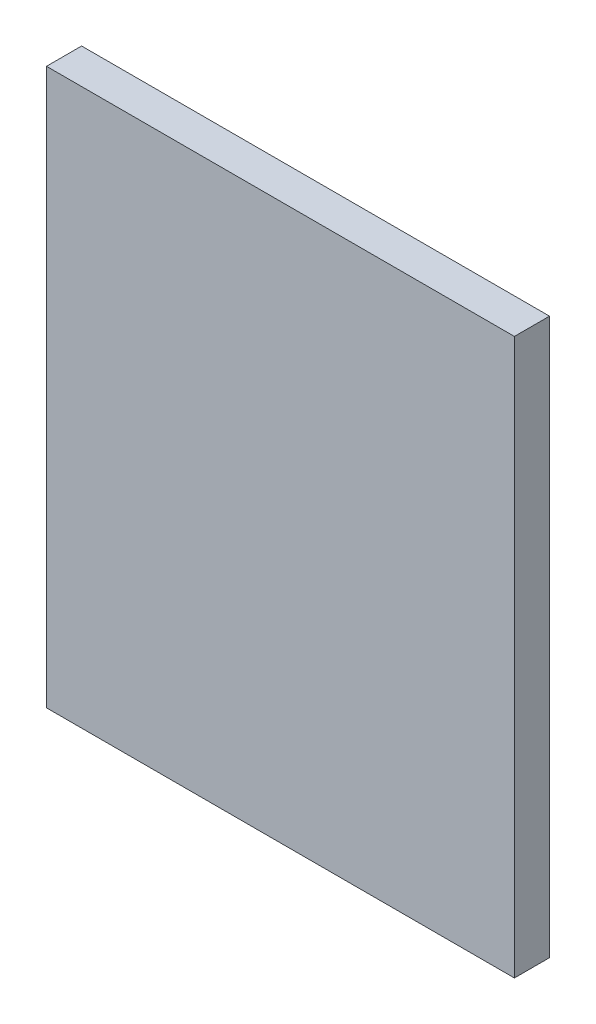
ISO-10303-21;
HEADER;
FILE_DESCRIPTION(('STEP AP214'),'2;1');
FILE_NAME('part.step','',(''),(''),'','','');
FILE_SCHEMA(('AUTOMOTIVE_DESIGN { 1 0 10303 214 1 1 1 1 }'));
ENDSEC;
DATA;
#1=APPLICATION_CONTEXT('core data for automotive mechanical design processes');
#2=APPLICATION_PROTOCOL_DEFINITION('international standard','automotive_design',2000,#1);
#3=PRODUCT_CONTEXT('',#1,'mechanical');
#4=PRODUCT('Part','Part','',(#3));
#5=PRODUCT_RELATED_PRODUCT_CATEGORY('part','',(#4));
#6=PRODUCT_DEFINITION_FORMATION('','',#4);
#7=PRODUCT_DEFINITION_CONTEXT('part definition',#1,'design');
#8=PRODUCT_DEFINITION('design','',#6,#7);
#9=PRODUCT_DEFINITION_SHAPE('','',#8);
#10=(LENGTH_UNIT() NAMED_UNIT(*) SI_UNIT(.MILLI.,.METRE.));
#11=(NAMED_UNIT(*) PLANE_ANGLE_UNIT() SI_UNIT($,.RADIAN.));
#12=(NAMED_UNIT(*) SI_UNIT($,.STERADIAN.) SOLID_ANGLE_UNIT());
#13=UNCERTAINTY_MEASURE_WITH_UNIT(LENGTH_MEASURE(1.E-05),#10,'distance_accuracy_value','');
#14=(GEOMETRIC_REPRESENTATION_CONTEXT(3) GLOBAL_UNCERTAINTY_ASSIGNED_CONTEXT((#13)) GLOBAL_UNIT_ASSIGNED_CONTEXT((#10,
#11,#12)) REPRESENTATION_CONTEXT('',''));
#15=CARTESIAN_POINT('',(0.,0.,0.));
#16=DIRECTION('',(0.,0.,1.));
#17=DIRECTION('',(1.,0.,0.));
#18=AXIS2_PLACEMENT_3D('',#15,#16,#17);
#19=CARTESIAN_POINT('',(0.,0.,0.61000132));
#20=DIRECTION('',(0.,0.,-1.));
#21=DIRECTION('',(0.,-1.,0.));
#22=AXIS2_PLACEMENT_3D('',#19,#20,#21);
#23=PLANE('',#22);
#24=DIRECTION('',(0.,1.,0.));
#25=VECTOR('',#24,1.);
#26=CARTESIAN_POINT('',(-4.064,-4.826,0.61000132));
#27=LINE('',#26,#25);
#28=CARTESIAN_POINT('',(-4.064,-4.826,0.61000132));
#29=VERTEX_POINT('',#28);
#30=CARTESIAN_POINT('',(-4.064,4.826,0.61000132));
#31=VERTEX_POINT('',#30);
#32=EDGE_CURVE('E28',#29,#31,#27,.T.);
#33=ORIENTED_EDGE('',*,*,#32,.F.);
#34=DIRECTION('',(-1.,0.,0.));
#35=VECTOR('',#34,1.);
#36=CARTESIAN_POINT('',(4.064,-4.826,0.61000132));
#37=LINE('',#36,#35);
#38=CARTESIAN_POINT('',(4.064,-4.826,0.61000132));
#39=VERTEX_POINT('',#38);
#40=EDGE_CURVE('E78',#39,#29,#37,.T.);
#41=ORIENTED_EDGE('',*,*,#40,.F.);
#42=DIRECTION('',(0.,-1.,0.));
#43=VECTOR('',#42,1.);
#44=CARTESIAN_POINT('',(4.064,4.826,0.61000132));
#45=LINE('',#44,#43);
#46=CARTESIAN_POINT('',(4.064,4.826,0.61000132));
#47=VERTEX_POINT('',#46);
#48=EDGE_CURVE('E82',#47,#39,#45,.T.);
#49=ORIENTED_EDGE('',*,*,#48,.F.);
#50=DIRECTION('',(1.,0.,0.));
#51=VECTOR('',#50,1.);
#52=CARTESIAN_POINT('',(-4.064,4.826,0.61000132));
#53=LINE('',#52,#51);
#54=EDGE_CURVE('E107',#31,#47,#53,.T.);
#55=ORIENTED_EDGE('',*,*,#54,.F.);
#56=EDGE_LOOP('',(#33,#41,#49,#55));
#57=FACE_BOUND('',#56,.T.);
#58=ADVANCED_FACE('F17',(#57),#23,.F.);
#59=CARTESIAN_POINT('',(0.,0.,0.));
#60=DIRECTION('',(0.,0.,-1.));
#61=DIRECTION('',(0.,-1.,0.));
#62=AXIS2_PLACEMENT_3D('',#59,#60,#61);
#63=PLANE('',#62);
#64=DIRECTION('',(1.,0.,0.));
#65=VECTOR('',#64,1.);
#66=CARTESIAN_POINT('',(-4.064,4.826,0.));
#67=LINE('',#66,#65);
#68=CARTESIAN_POINT('',(-4.064,4.826,0.));
#69=VERTEX_POINT('',#68);
#70=CARTESIAN_POINT('',(4.064,4.826,0.));
#71=VERTEX_POINT('',#70);
#72=EDGE_CURVE('E73',#69,#71,#67,.T.);
#73=ORIENTED_EDGE('',*,*,#72,.T.);
#74=DIRECTION('',(0.,-1.,0.));
#75=VECTOR('',#74,1.);
#76=CARTESIAN_POINT('',(4.064,4.826,0.));
#77=LINE('',#76,#75);
#78=CARTESIAN_POINT('',(4.064,-4.826,0.));
#79=VERTEX_POINT('',#78);
#80=EDGE_CURVE('E71',#71,#79,#77,.T.);
#81=ORIENTED_EDGE('',*,*,#80,.T.);
#82=DIRECTION('',(-1.,0.,0.));
#83=VECTOR('',#82,1.);
#84=CARTESIAN_POINT('',(4.064,-4.826,0.));
#85=LINE('',#84,#83);
#86=CARTESIAN_POINT('',(-4.064,-4.826,0.));
#87=VERTEX_POINT('',#86);
#88=EDGE_CURVE('E60',#79,#87,#85,.T.);
#89=ORIENTED_EDGE('',*,*,#88,.T.);
#90=DIRECTION('',(0.,1.,0.));
#91=VECTOR('',#90,1.);
#92=CARTESIAN_POINT('',(-4.064,-4.826,0.));
#93=LINE('',#92,#91);
#94=EDGE_CURVE('E11',#87,#69,#93,.T.);
#95=ORIENTED_EDGE('',*,*,#94,.T.);
#96=EDGE_LOOP('',(#73,#81,#89,#95));
#97=FACE_BOUND('',#96,.T.);
#98=ADVANCED_FACE('F19',(#97),#63,.T.);
#99=CARTESIAN_POINT('',(-4.064,-4.826,0.));
#100=DIRECTION('',(-1.,0.,0.));
#101=DIRECTION('',(0.,0.,1.));
#102=AXIS2_PLACEMENT_3D('',#99,#100,#101);
#103=PLANE('',#102);
#104=DIRECTION('',(0.,0.,1.));
#105=VECTOR('',#104,1.);
#106=CARTESIAN_POINT('',(-4.064,-4.826,0.));
#107=LINE('',#106,#105);
#108=EDGE_CURVE('E66',#87,#29,#107,.T.);
#109=ORIENTED_EDGE('',*,*,#108,.T.);
#110=ORIENTED_EDGE('',*,*,#32,.T.);
#111=DIRECTION('',(0.,0.,1.));
#112=VECTOR('',#111,1.);
#113=CARTESIAN_POINT('',(-4.064,4.826,0.));
#114=LINE('',#113,#112);
#115=EDGE_CURVE('E103',#69,#31,#114,.T.);
#116=ORIENTED_EDGE('',*,*,#115,.F.);
#117=ORIENTED_EDGE('',*,*,#94,.F.);
#118=EDGE_LOOP('',(#109,#110,#116,#117));
#119=FACE_BOUND('',#118,.T.);
#120=ADVANCED_FACE('F128',(#119),#103,.T.);
#121=CARTESIAN_POINT('',(4.064,-4.826,0.));
#122=DIRECTION('',(0.,-1.,0.));
#123=DIRECTION('',(0.,0.,-1.));
#124=AXIS2_PLACEMENT_3D('',#121,#122,#123);
#125=PLANE('',#124);
#126=DIRECTION('',(0.,0.,1.));
#127=VECTOR('',#126,1.);
#128=CARTESIAN_POINT('',(4.064,-4.826,0.));
#129=LINE('',#128,#127);
#130=EDGE_CURVE('E21',#79,#39,#129,.T.);
#131=ORIENTED_EDGE('',*,*,#130,.T.);
#132=ORIENTED_EDGE('',*,*,#40,.T.);
#133=ORIENTED_EDGE('',*,*,#108,.F.);
#134=ORIENTED_EDGE('',*,*,#88,.F.);
#135=EDGE_LOOP('',(#131,#132,#133,#134));
#136=FACE_BOUND('',#135,.T.);
#137=ADVANCED_FACE('F62',(#136),#125,.T.);
#138=CARTESIAN_POINT('',(4.064,4.826,0.));
#139=DIRECTION('',(1.,0.,0.));
#140=DIRECTION('',(0.,1.,0.));
#141=AXIS2_PLACEMENT_3D('',#138,#139,#140);
#142=PLANE('',#141);
#143=DIRECTION('',(0.,0.,1.));
#144=VECTOR('',#143,1.);
#145=CARTESIAN_POINT('',(4.064,4.826,0.));
#146=LINE('',#145,#144);
#147=EDGE_CURVE('E92',#71,#47,#146,.T.);
#148=ORIENTED_EDGE('',*,*,#147,.T.);
#149=ORIENTED_EDGE('',*,*,#48,.T.);
#150=ORIENTED_EDGE('',*,*,#130,.F.);
#151=ORIENTED_EDGE('',*,*,#80,.F.);
#152=EDGE_LOOP('',(#148,#149,#150,#151));
#153=FACE_BOUND('',#152,.T.);
#154=ADVANCED_FACE('F80',(#153),#142,.T.);
#155=CARTESIAN_POINT('',(-4.064,4.826,0.));
#156=DIRECTION('',(0.,1.,0.));
#157=DIRECTION('',(1.,0.,0.));
#158=AXIS2_PLACEMENT_3D('',#155,#156,#157);
#159=PLANE('',#158);
#160=ORIENTED_EDGE('',*,*,#115,.T.);
#161=ORIENTED_EDGE('',*,*,#54,.T.);
#162=ORIENTED_EDGE('',*,*,#147,.F.);
#163=ORIENTED_EDGE('',*,*,#72,.F.);
#164=EDGE_LOOP('',(#160,#161,#162,#163));
#165=FACE_BOUND('',#164,.T.);
#166=ADVANCED_FACE('F119',(#165),#159,.T.);
#167=CLOSED_SHELL('',(#58,#98,#120,#137,#154,#166));
#168=MANIFOLD_SOLID_BREP('B1',#167);
#169=ADVANCED_BREP_SHAPE_REPRESENTATION('',(#18,#168),#14);
#170=SHAPE_DEFINITION_REPRESENTATION(#9,#169);
ENDSEC;
END-ISO-10303-21;
